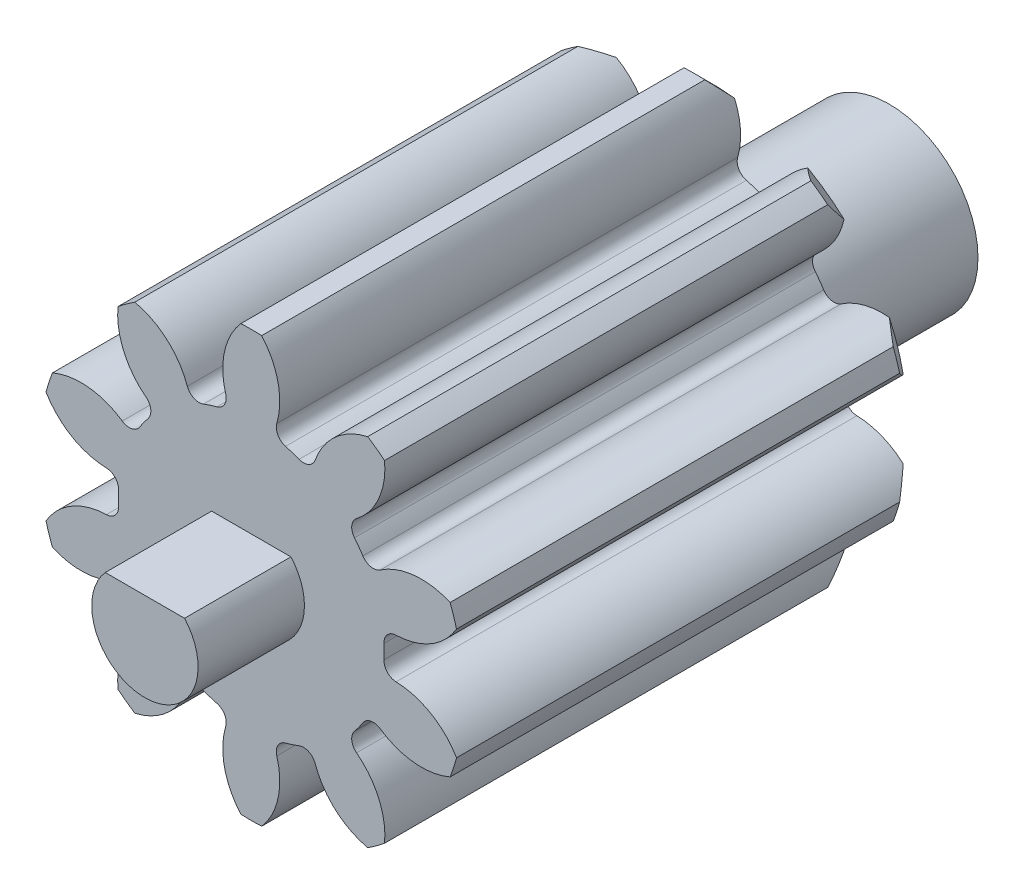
from build123d import *

# Parameters (mm, degrees)
ESQUISSE1_R                               = 2.5
BASE_EXTRUSION_DEPTH                      = 5
BOSS_EXTRU_1_DEPTH                        = 13
CONG_1_R                                  = 0.35
CHANFREIN1_SIZE                           = 0.5
R_P_TITION_CIRCULAIRE4_COUNT              = 10
CONG_1_OF_R_P_TITION_CIRCULAIRE4_R        = 0.35
CHANFREIN1_OF_R_P_TITION_CIRCULAIRE4_SIZE = 0.5
BOSS_EXTRU_2_DEPTH                        = 3


with BuildPart() as part:
    # Esquisse1 → Base-Extrusion (new body)
    with BuildSketch(Plane.XY):
        Circle(ESQUISSE1_R)
    extrude(amount=BASE_EXTRUSION_DEPTH)

    # Esquisse3 → Boss.-Extru.1 (add)
    with BuildSketch(Plane.XY.offset(5)):
        with BuildLine():
            Line((-1.158813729, 3.566461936), (0, 0))
            Line((0, 0), (1.158813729, 3.566461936))
            ThreePointArc((1.158813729, 3.566461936), (0.871562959, 3.647311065), (0.578793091, 3.705063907))
            ThreePointArc((0.578793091, 3.705063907), (0.788379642, 4.892808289), (0.293738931, 5.992805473))
            ThreePointArc((0.293738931, 5.992805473), (0, 6), (-0.293738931, 5.992805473))
            ThreePointArc((-0.293738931, 5.992805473), (-0.788379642, 4.892808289), (-0.578793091, 3.705063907))
            ThreePointArc((-0.578793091, 3.705063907), (-0.871562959, 3.647311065), (-1.158813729, 3.566461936))
        make_face()
    boss_extru_1 = extrude(amount=BOSS_EXTRU_1_DEPTH)

    # Cong_1
    cong_1_edges = [part.edges().sort_by_distance(p)[0] for p in [
        (0.578793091, 3.705063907, 11.5),
        (-0.578793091, 3.705063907, 11.5),
    ]]
    fillet(cong_1_edges, radius=CONG_1_R)

    # Chanfrein1
    chanfrein1_edges = [part.edges().sort_by_distance(p)[0] for p in [
        (0, 6, 5),
    ]]
    chamfer(chanfrein1_edges, length=CHANFREIN1_SIZE)

    # R_p_tition circulaire4: Boss.-Extru.1 ×10 about axis
    r_p_tition_circulaire4_axis = Axis((0, 0, 0), (0, 0, 1))
    for i in range(1, R_P_TITION_CIRCULAIRE4_COUNT):
        add(boss_extru_1.rotate(r_p_tition_circulaire4_axis, i * 360 / R_P_TITION_CIRCULAIRE4_COUNT))

    # Cong_1 of R_p_tition circulaire4
    cong_1_of_r_p_tition_circulaire4_edges = [part.edges().sort_by_distance(p)[0] for p in [
        (-1.709528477, 3.337665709, 11.5),
        (-2.646035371, 2.657253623, 11.5),
        (-3.344868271, 1.695392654, 11.5),
        (-3.702582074, 0.594462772, 11.5),
        (-3.702582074, -0.594462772, 11.5),
        (-3.344868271, -1.695392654, 11.5),
        (-2.646035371, -2.657253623, 11.5),
        (-1.709528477, -3.337665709, 11.5),
        (-0.578793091, -3.705063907, 11.5),
        (0.578793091, -3.705063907, 11.5),
        (1.709528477, -3.337665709, 11.5),
        (2.646035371, -2.657253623, 11.5),
        (3.344868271, -1.695392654, 11.5),
        (3.702582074, -0.594462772, 11.5),
        (3.702582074, 0.594462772, 11.5),
        (3.344868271, 1.695392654, 11.5),
        (2.646035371, 2.657253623, 11.5),
        (1.709528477, 3.337665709, 11.5),
    ]]
    fillet(cong_1_of_r_p_tition_circulaire4_edges, radius=CONG_1_OF_R_P_TITION_CIRCULAIRE4_R)

    # Chanfrein1 of R_p_tition circulaire4
    chanfrein1_of_r_p_tition_circulaire4_edges = [part.edges().sort_by_distance(p)[0] for p in [
        (-3.526711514, 4.854101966, 5),
        (-5.706339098, 1.854101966, 5),
        (-5.706339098, -1.854101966, 5),
        (-3.526711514, -4.854101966, 5),
        (0, -6, 5),
        (3.526711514, -4.854101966, 5),
        (5.706339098, -1.854101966, 5),
        (5.706339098, 1.854101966, 5),
        (3.526711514, 4.854101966, 5),
    ]]
    chamfer(chanfrein1_of_r_p_tition_circulaire4_edges, length=CHANFREIN1_OF_R_P_TITION_CIRCULAIRE4_SIZE)

    # Esquisse4 → Boss.-Extru.2 (add)
    with BuildSketch(Plane.XY.offset(18)):
        with BuildLine():
            Line((-1.118033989, 1), (1.118033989, 1))
            ThreePointArc((1.118033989, 1), (0, -1.5), (-1.118033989, 1))
        make_face()
    extrude(amount=BOSS_EXTRU_2_DEPTH)


solid = part.part
